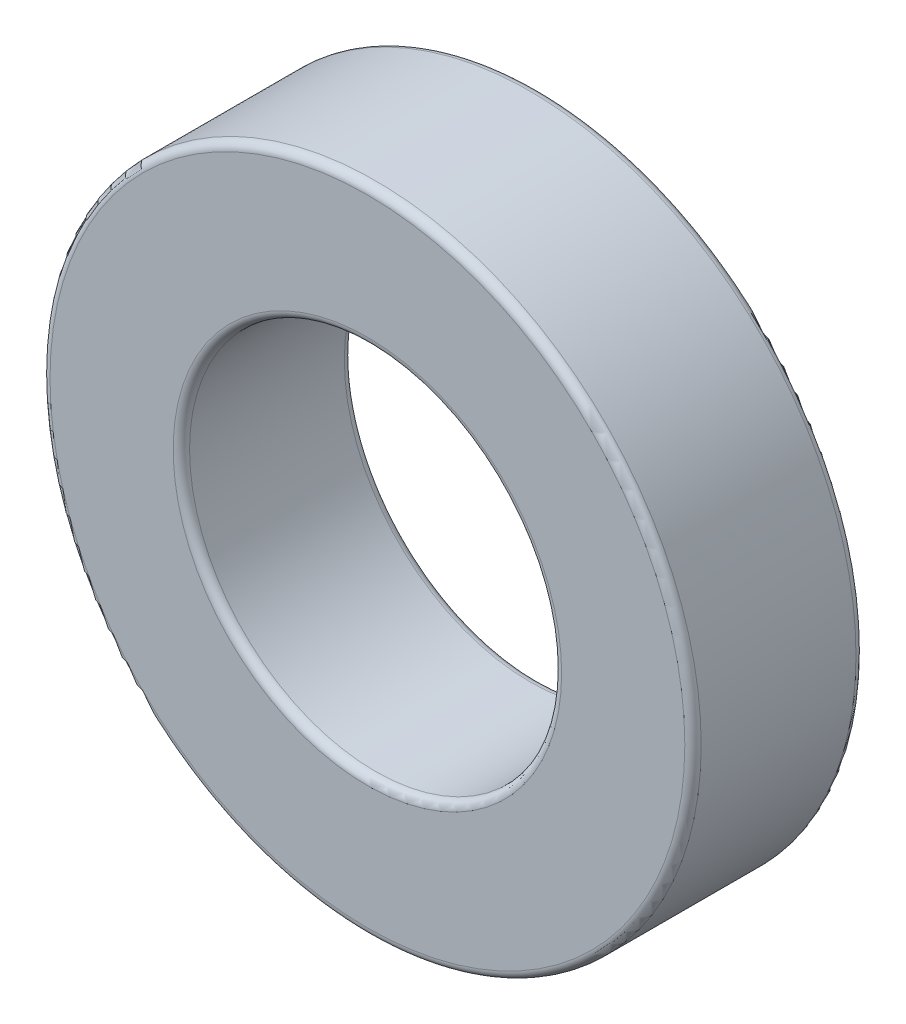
from build123d import *


with BuildPart() as part:
    # E_corps → Corps (revolve)
    with BuildSketch(Plane(origin=(0, 0, 0), x_dir=(1, 0, 0), z_dir=(0, 1, 0)), mode=Mode.PRIVATE) as corps_sk:
        with BuildLine():
            Line((-43.75, 1.1), (-43.75, 21.9))
            ThreePointArc((-43.75, 21.9), (-43.427817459, 22.677817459), (-42.65, 23))
            Line((-42.65, 23), (-26.1, 23))
            ThreePointArc((-26.1, 23), (-25.322182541, 22.677817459), (-25, 21.9))
            Line((-25, 21.9), (-25, 1.1))
            ThreePointArc((-25, 1.1), (-25.322182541, 0.322182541), (-26.1, 0))
            Line((-26.1, 0), (-42.65, 0))
            ThreePointArc((-42.65, 0), (-43.427817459, 0.322182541), (-43.75, 1.1))
        make_face()
    revolve(corps_sk.sketch.rotate(Axis((0, 0, 80), (0, 0, -1)), 180), axis=Axis((0, 0, 80), (0, 0, -1)))

    # E_symbole1 → Symbole1 (revolve, cut)
    with BuildSketch(Plane(origin=(0, 0, 0), x_dir=(1, 0, 0), z_dir=(0, 1, 0))):
        with BuildLine():
            Line((-33.060246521, 0.01), (-33.050800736, 0.013282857))
            ThreePointArc((-33.050800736, 0.013282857), (-34.99, 11.5), (-33.050800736, 22.986717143))
            Line((-33.050800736, 22.986717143), (-33.060246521, 22.99))
            ThreePointArc((-33.060246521, 22.99), (-35, 11.5), (-33.060246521, 0.01))
        make_face()
    revolve(axis=Axis((0, 0, 8.33004658), (0, 0, -1)), mode=Mode.SUBTRACT)

    # E_symbole2 → Symbole2 (revolve, cut)
    with BuildSketch(Plane(origin=(0, 0, 0), x_dir=(1, 0, 0), z_dir=(0, 1, 0))):
        with BuildLine():
            Line((-31.272799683, 2.99), (-31.263150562, 2.992625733))
            ThreePointArc((-31.263150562, 2.992625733), (-31.882104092, 5.730126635), (-32.261825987, 8.510922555))
            Line((-32.261825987, 8.510922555), (-32.271783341, 8.51))
            ThreePointArc((-32.271783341, 8.51), (-31.891944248, 5.72834581), (-31.272799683, 2.99))
        make_face()
    revolve(axis=Axis((0, 0, 10.578556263), (0, 0, -1)), mode=Mode.SUBTRACT)

    # E_symbole3 → Symbole3 (revolve, cut)
    with BuildSketch(Plane(origin=(0, 0, 0), x_dir=(1, 0, 0), z_dir=(0, 1, 0))):
        with BuildLine():
            Line((-31.262435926, 20.01), (-31.252787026, 20.007373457))
            ThreePointArc((-31.252787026, 20.007373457), (-31.871939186, 17.269886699), (-32.251783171, 14.48907716))
            Line((-32.251783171, 14.48907716), (-32.261740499, 14.49))
            ThreePointArc((-32.261740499, 14.49), (-31.881779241, 17.271668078), (-31.262435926, 20.01))
        make_face()
    revolve(axis=Axis((0, 0, 5.656639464), (0, 0, -1)), mode=Mode.SUBTRACT)


solid = part.part
